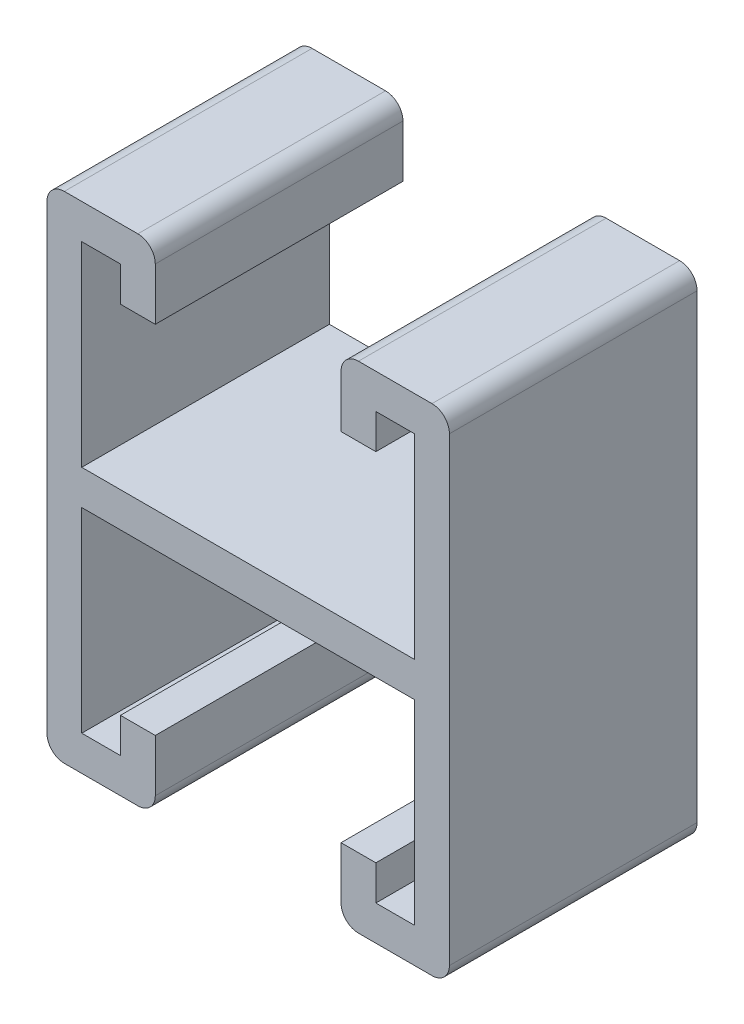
from build123d import *

# Parameters (mm, degrees)
BASE_EXTRUDE_DEPTH = 12.7


with BuildPart() as part:
    # Sketch1 → Base-Extrude (new, symmetric)
    with BuildSketch(Plane.XY):
        with BuildLine():
            Line((-11.3109375, 25.4), (-18.8515625, 25.4))
            ThreePointArc((-18.8515625, 25.4), (-20.114411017, 24.876911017), (-20.6375, 23.6140625))
            Line((-20.6375, 23.6140625), (-20.6375, -23.6140625))
            ThreePointArc((-20.6375, -23.6140625), (-20.114411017, -24.876911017), (-18.8515625, -25.4))
            Line((-18.8515625, -25.4), (-11.3109375, -25.4))
            ThreePointArc((-11.3109375, -25.4), (-10.048088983, -24.876911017), (-9.525, -23.6140625))
            Line((-9.525, -23.6140625), (-9.525, -18.25625))
            Line((-9.525, -18.25625), (-13.096875, -18.25625))
            Line((-13.096875, -18.25625), (-13.096875, -21.828125))
            Line((-13.096875, -21.828125), (-17.065625, -21.828125))
            Line((-17.065625, -21.828125), (-17.065625, -1.7859375))
            Line((-17.065625, -1.7859375), (17.065625, -1.7859375))
            Line((17.065625, -1.7859375), (17.065625, -21.828125))
            Line((17.065625, -21.828125), (13.096875, -21.828125))
            Line((13.096875, -21.828125), (13.096875, -18.25625))
            Line((13.096875, -18.25625), (9.525, -18.25625))
            Line((9.525, -18.25625), (9.525, -23.6140625))
            ThreePointArc((9.525, -23.6140625), (10.048088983, -24.876911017), (11.3109375, -25.4))
            Line((11.3109375, -25.4), (18.8515625, -25.4))
            ThreePointArc((18.8515625, -25.4), (20.114411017, -24.876911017), (20.6375, -23.6140625))
            Line((20.6375, -23.6140625), (20.6375, 23.6140625))
            ThreePointArc((20.6375, 23.6140625), (20.114411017, 24.876911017), (18.8515625, 25.4))
            Line((18.8515625, 25.4), (11.3109375, 25.4))
            ThreePointArc((11.3109375, 25.4), (10.048088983, 24.876911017), (9.525, 23.6140625))
            Line((9.525, 23.6140625), (9.525, 18.25625))
            Line((9.525, 18.25625), (13.096875, 18.25625))
            Line((13.096875, 18.25625), (13.096875, 21.828125))
            Line((13.096875, 21.828125), (17.065625, 21.828125))
            Line((17.065625, 21.828125), (17.065625, 1.7859375))
            Line((17.065625, 1.7859375), (-17.065625, 1.7859375))
            Line((-17.065625, 1.7859375), (-17.065625, 21.828125))
            Line((-17.065625, 21.828125), (-13.096875, 21.828125))
            Line((-13.096875, 21.828125), (-13.096875, 18.25625))
            Line((-13.096875, 18.25625), (-9.525, 18.25625))
            Line((-9.525, 18.25625), (-9.525, 23.6140625))
            ThreePointArc((-9.525, 23.6140625), (-10.048088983, 24.876911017), (-11.3109375, 25.4))
        make_face()
    extrude(amount=BASE_EXTRUDE_DEPTH, both=True)


solid = part.part
